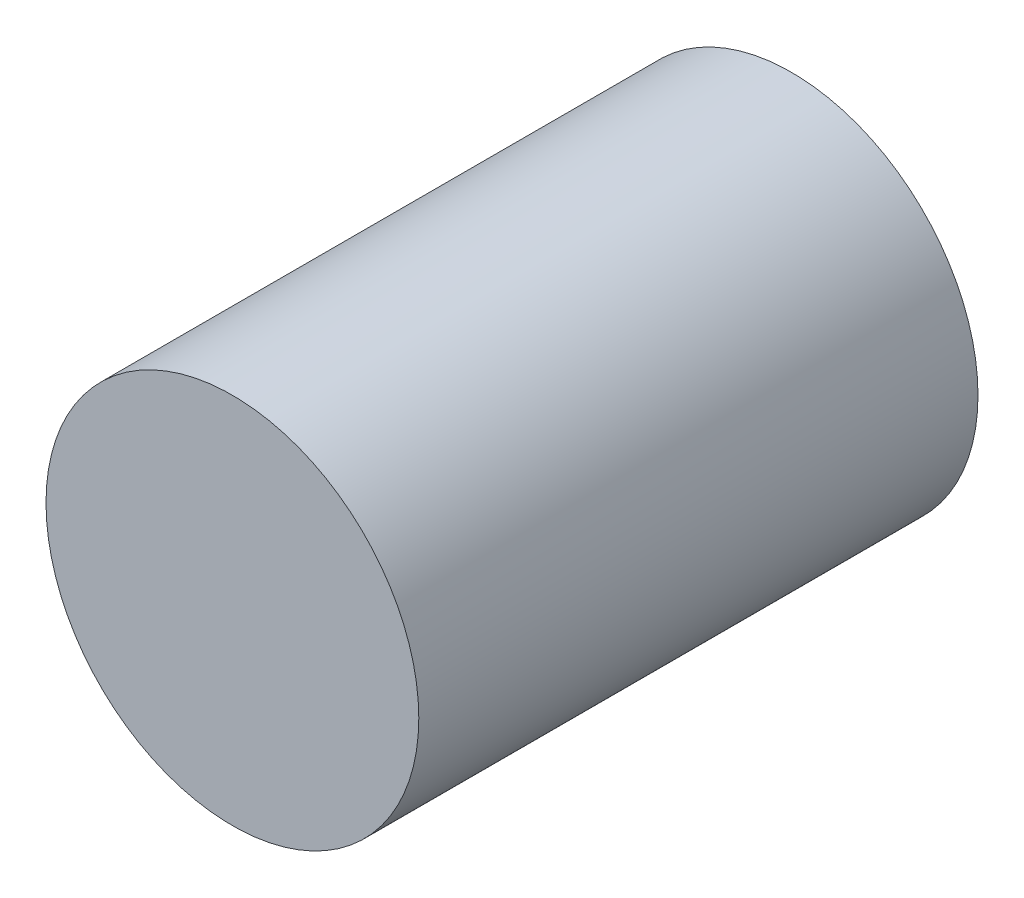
from build123d import *

# Parameters (mm, degrees)
SKIZZE1_R                       = 10
AUFSATZ_LINEAR_AUSTRAGEN1_DEPTH = 30


with BuildPart() as part:
    # Skizze1 → Aufsatz-Linear austragen1 (new body)
    with BuildSketch(Plane.XY):
        Circle(SKIZZE1_R)
    extrude(amount=AUFSATZ_LINEAR_AUSTRAGEN1_DEPTH)


solid = part.part
